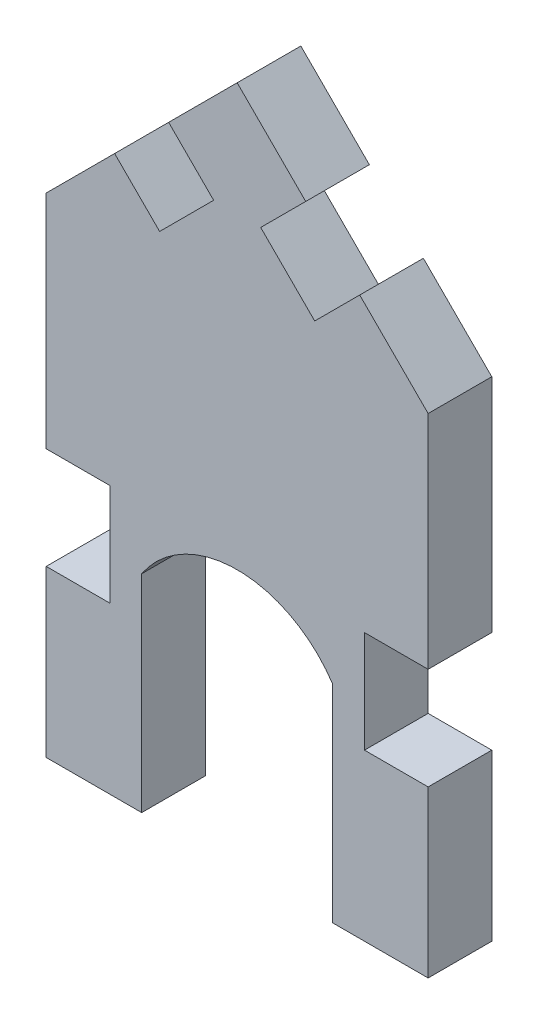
ISO-10303-21;
HEADER;
FILE_DESCRIPTION(('STEP AP214'),'2;1');
FILE_NAME('part.step','',(''),(''),'','','');
FILE_SCHEMA(('AUTOMOTIVE_DESIGN { 1 0 10303 214 1 1 1 1 }'));
ENDSEC;
DATA;
#1=APPLICATION_CONTEXT('core data for automotive mechanical design processes');
#2=APPLICATION_PROTOCOL_DEFINITION('international standard','automotive_design',2000,#1);
#3=PRODUCT_CONTEXT('',#1,'mechanical');
#4=PRODUCT('Part','Part','',(#3));
#5=PRODUCT_RELATED_PRODUCT_CATEGORY('part','',(#4));
#6=PRODUCT_DEFINITION_FORMATION('','',#4);
#7=PRODUCT_DEFINITION_CONTEXT('part definition',#1,'design');
#8=PRODUCT_DEFINITION('design','',#6,#7);
#9=PRODUCT_DEFINITION_SHAPE('','',#8);
#10=(LENGTH_UNIT() NAMED_UNIT(*) SI_UNIT(.MILLI.,.METRE.));
#11=(NAMED_UNIT(*) PLANE_ANGLE_UNIT() SI_UNIT($,.RADIAN.));
#12=(NAMED_UNIT(*) SI_UNIT($,.STERADIAN.) SOLID_ANGLE_UNIT());
#13=UNCERTAINTY_MEASURE_WITH_UNIT(LENGTH_MEASURE(1.E-05),#10,'distance_accuracy_value','');
#14=(GEOMETRIC_REPRESENTATION_CONTEXT(3) GLOBAL_UNCERTAINTY_ASSIGNED_CONTEXT((#13)) GLOBAL_UNIT_ASSIGNED_CONTEXT((#10,
#11,#12)) REPRESENTATION_CONTEXT('',''));
#15=CARTESIAN_POINT('',(0.,0.,0.));
#16=DIRECTION('',(0.,0.,1.));
#17=DIRECTION('',(1.,0.,0.));
#18=AXIS2_PLACEMENT_3D('',#15,#16,#17);
#19=CARTESIAN_POINT('',(21.209,21.2090000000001,6.35));
#20=DIRECTION('',(0.707106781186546,0.707106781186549,0.));
#21=DIRECTION('',(-0.707106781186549,0.707106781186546,0.));
#22=AXIS2_PLACEMENT_3D('',#19,#20,#21);
#23=PLANE('',#22);
#24=DIRECTION('',(0.,0.,1.));
#25=VECTOR('',#24,1.);
#26=CARTESIAN_POINT('',(-6.8249946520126,49.2429946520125,0.));
#27=LINE('',#26,#25);
#28=CARTESIAN_POINT('',(-6.8249946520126,49.2429946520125,0.));
#29=VERTEX_POINT('',#28);
#30=CARTESIAN_POINT('',(-6.8249946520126,49.2429946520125,6.35));
#31=VERTEX_POINT('',#30);
#32=EDGE_CURVE('E210',#29,#31,#27,.T.);
#33=ORIENTED_EDGE('',*,*,#32,.T.);
#34=DIRECTION('',(0.707106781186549,-0.707106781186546,0.));
#35=VECTOR('',#34,1.);
#36=CARTESIAN_POINT('',(21.209,21.2090000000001,6.35));
#37=LINE('',#36,#35);
#38=CARTESIAN_POINT('',(0.,42.418,6.35));
#39=VERTEX_POINT('',#38);
#40=EDGE_CURVE('E268',#31,#39,#37,.T.);
#41=ORIENTED_EDGE('',*,*,#40,.T.);
#42=DIRECTION('',(0.,0.,-1.));
#43=VECTOR('',#42,1.);
#44=CARTESIAN_POINT('',(0.,42.418,6.35));
#45=LINE('',#44,#43);
#46=CARTESIAN_POINT('',(0.,42.418,0.));
#47=VERTEX_POINT('',#46);
#48=EDGE_CURVE('E232',#39,#47,#45,.T.);
#49=ORIENTED_EDGE('',*,*,#48,.T.);
#50=DIRECTION('',(0.707106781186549,-0.707106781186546,0.));
#51=VECTOR('',#50,1.);
#52=CARTESIAN_POINT('',(21.209,21.2090000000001,0.));
#53=LINE('',#52,#51);
#54=EDGE_CURVE('E224',#29,#47,#53,.T.);
#55=ORIENTED_EDGE('',*,*,#54,.F.);
#56=EDGE_LOOP('',(#33,#41,#49,#55));
#57=FACE_BOUND('',#56,.T.);
#58=ADVANCED_FACE('F43',(#57),#23,.T.);
#59=CARTESIAN_POINT('',(-40.2589999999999,40.2590000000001,6.35));
#60=DIRECTION('',(-0.707106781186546,0.707106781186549,0.));
#61=DIRECTION('',(-0.707106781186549,-0.707106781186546,0.));
#62=AXIS2_PLACEMENT_3D('',#59,#60,#61);
#63=PLANE('',#62);
#64=DIRECTION('',(0.,0.,1.));
#65=VECTOR('',#64,1.);
#66=CARTESIAN_POINT('',(-31.2750053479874,49.2429946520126,0.));
#67=LINE('',#66,#65);
#68=CARTESIAN_POINT('',(-31.2750053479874,49.2429946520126,0.));
#69=VERTEX_POINT('',#68);
#70=CARTESIAN_POINT('',(-31.2750053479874,49.2429946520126,6.35));
#71=VERTEX_POINT('',#70);
#72=EDGE_CURVE('E297',#69,#71,#67,.T.);
#73=ORIENTED_EDGE('',*,*,#72,.F.);
#74=DIRECTION('',(0.707106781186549,0.707106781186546,0.));
#75=VECTOR('',#74,1.);
#76=CARTESIAN_POINT('',(-40.2589999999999,40.2590000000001,0.));
#77=LINE('',#76,#75);
#78=CARTESIAN_POINT('',(-38.1,42.418,0.));
#79=VERTEX_POINT('',#78);
#80=EDGE_CURVE('E245',#79,#69,#77,.T.);
#81=ORIENTED_EDGE('',*,*,#80,.F.);
#82=DIRECTION('',(0.,0.,-1.));
#83=VECTOR('',#82,1.);
#84=CARTESIAN_POINT('',(-38.1,42.418,6.35));
#85=LINE('',#84,#83);
#86=CARTESIAN_POINT('',(-38.1,42.418,6.35));
#87=VERTEX_POINT('',#86);
#88=EDGE_CURVE('E51',#87,#79,#85,.T.);
#89=ORIENTED_EDGE('',*,*,#88,.F.);
#90=DIRECTION('',(0.707106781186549,0.707106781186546,0.));
#91=VECTOR('',#90,1.);
#92=CARTESIAN_POINT('',(-40.2589999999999,40.2590000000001,6.35));
#93=LINE('',#92,#91);
#94=EDGE_CURVE('E357',#87,#71,#93,.T.);
#95=ORIENTED_EDGE('',*,*,#94,.T.);
#96=EDGE_LOOP('',(#73,#81,#89,#95));
#97=FACE_BOUND('',#96,.T.);
#98=ADVANCED_FACE('F296',(#97),#63,.T.);
#99=CARTESIAN_POINT('',(-38.1,0.,6.35));
#100=DIRECTION('',(-1.,0.,0.));
#101=DIRECTION('',(0.,-1.,0.));
#102=AXIS2_PLACEMENT_3D('',#99,#100,#101);
#103=PLANE('',#102);
#104=DIRECTION('',(0.,0.,1.));
#105=VECTOR('',#104,1.);
#106=CARTESIAN_POINT('',(-38.1,20.32,0.));
#107=LINE('',#106,#105);
#108=CARTESIAN_POINT('',(-38.1,20.32,0.));
#109=VERTEX_POINT('',#108);
#110=CARTESIAN_POINT('',(-38.1,20.32,6.35));
#111=VERTEX_POINT('',#110);
#112=EDGE_CURVE('E234',#109,#111,#107,.T.);
#113=ORIENTED_EDGE('',*,*,#112,.T.);
#114=DIRECTION('',(0.,1.,0.));
#115=VECTOR('',#114,1.);
#116=CARTESIAN_POINT('',(-38.1,0.,6.35));
#117=LINE('',#116,#115);
#118=EDGE_CURVE('E291',#111,#87,#117,.T.);
#119=ORIENTED_EDGE('',*,*,#118,.T.);
#120=ORIENTED_EDGE('',*,*,#88,.T.);
#121=DIRECTION('',(0.,1.,0.));
#122=VECTOR('',#121,1.);
#123=CARTESIAN_POINT('',(-38.1,0.,0.));
#124=LINE('',#123,#122);
#125=EDGE_CURVE('E248',#109,#79,#124,.T.);
#126=ORIENTED_EDGE('',*,*,#125,.F.);
#127=EDGE_LOOP('',(#113,#119,#120,#126));
#128=FACE_BOUND('',#127,.T.);
#129=ADVANCED_FACE('F289',(#128),#103,.T.);
#130=CARTESIAN_POINT('',(0.,0.,6.35));
#131=DIRECTION('',(-1.,0.,0.));
#132=DIRECTION('',(0.,0.,1.));
#133=AXIS2_PLACEMENT_3D('',#130,#131,#132);
#134=PLANE('',#133);
#135=DIRECTION('',(0.,1.,0.));
#136=VECTOR('',#135,1.);
#137=CARTESIAN_POINT('',(0.,0.,0.));
#138=LINE('',#137,#136);
#139=CARTESIAN_POINT('',(0.,-6.35,0.));
#140=VERTEX_POINT('',#139);
#141=CARTESIAN_POINT('',(0.,10.16,0.));
#142=VERTEX_POINT('',#141);
#143=EDGE_CURVE('E265',#140,#142,#138,.T.);
#144=ORIENTED_EDGE('',*,*,#143,.T.);
#145=DIRECTION('',(0.,0.,1.));
#146=VECTOR('',#145,1.);
#147=CARTESIAN_POINT('',(0.,10.16,0.));
#148=LINE('',#147,#146);
#149=CARTESIAN_POINT('',(0.,10.16,6.35));
#150=VERTEX_POINT('',#149);
#151=EDGE_CURVE('E334',#142,#150,#148,.T.);
#152=ORIENTED_EDGE('',*,*,#151,.T.);
#153=DIRECTION('',(0.,1.,0.));
#154=VECTOR('',#153,1.);
#155=CARTESIAN_POINT('',(0.,0.,6.35));
#156=LINE('',#155,#154);
#157=CARTESIAN_POINT('',(0.,-6.35,6.35));
#158=VERTEX_POINT('',#157);
#159=EDGE_CURVE('E243',#158,#150,#156,.T.);
#160=ORIENTED_EDGE('',*,*,#159,.F.);
#161=DIRECTION('',(0.,0.,-1.));
#162=VECTOR('',#161,1.);
#163=CARTESIAN_POINT('',(0.,-6.35,6.35));
#164=LINE('',#163,#162);
#165=EDGE_CURVE('E270',#158,#140,#164,.T.);
#166=ORIENTED_EDGE('',*,*,#165,.T.);
#167=EDGE_LOOP('',(#144,#152,#160,#166));
#168=FACE_BOUND('',#167,.T.);
#169=ADVANCED_FACE('F385',(#168),#134,.F.);
#170=DIRECTION('',(0.,0.,1.));
#171=VECTOR('',#170,1.);
#172=CARTESIAN_POINT('',(-12.2131483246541,54.631148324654,0.));
#173=LINE('',#172,#171);
#174=CARTESIAN_POINT('',(-12.2131483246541,54.631148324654,0.));
#175=VERTEX_POINT('',#174);
#176=CARTESIAN_POINT('',(-12.2131483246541,54.631148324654,6.35));
#177=VERTEX_POINT('',#176);
#178=EDGE_CURVE('E219',#175,#177,#173,.T.);
#179=ORIENTED_EDGE('',*,*,#178,.F.);
#180=CARTESIAN_POINT('',(-19.05,61.4679999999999,0.));
#181=VERTEX_POINT('',#180);
#182=EDGE_CURVE('E233',#181,#175,#53,.T.);
#183=ORIENTED_EDGE('',*,*,#182,.F.);
#184=DIRECTION('',(0.,0.,-1.));
#185=VECTOR('',#184,1.);
#186=CARTESIAN_POINT('',(-19.05,61.4679999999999,6.35));
#187=LINE('',#186,#185);
#188=CARTESIAN_POINT('',(-19.05,61.4679999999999,6.35));
#189=VERTEX_POINT('',#188);
#190=EDGE_CURVE('E11',#189,#181,#187,.T.);
#191=ORIENTED_EDGE('',*,*,#190,.F.);
#192=EDGE_CURVE('E353',#189,#177,#37,.T.);
#193=ORIENTED_EDGE('',*,*,#192,.T.);
#194=EDGE_LOOP('',(#179,#183,#191,#193));
#195=FACE_BOUND('',#194,.T.);
#196=ADVANCED_FACE('F45',(#195),#23,.T.);
#197=DIRECTION('',(0.,0.,1.));
#198=VECTOR('',#197,1.);
#199=CARTESIAN_POINT('',(-25.886851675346,54.631148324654,0.));
#200=LINE('',#199,#198);
#201=CARTESIAN_POINT('',(-25.886851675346,54.631148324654,0.));
#202=VERTEX_POINT('',#201);
#203=CARTESIAN_POINT('',(-25.886851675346,54.631148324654,6.35));
#204=VERTEX_POINT('',#203);
#205=EDGE_CURVE('E455',#202,#204,#200,.T.);
#206=ORIENTED_EDGE('',*,*,#205,.T.);
#207=EDGE_CURVE('E356',#204,#189,#93,.T.);
#208=ORIENTED_EDGE('',*,*,#207,.T.);
#209=ORIENTED_EDGE('',*,*,#190,.T.);
#210=EDGE_CURVE('E237',#202,#181,#77,.T.);
#211=ORIENTED_EDGE('',*,*,#210,.F.);
#212=EDGE_LOOP('',(#206,#208,#209,#211));
#213=FACE_BOUND('',#212,.T.);
#214=ADVANCED_FACE('F419',(#213),#63,.T.);
#215=DIRECTION('',(0.,0.,1.));
#216=VECTOR('',#215,1.);
#217=CARTESIAN_POINT('',(-38.1,10.16,0.));
#218=LINE('',#217,#216);
#219=CARTESIAN_POINT('',(-38.1,10.16,0.));
#220=VERTEX_POINT('',#219);
#221=CARTESIAN_POINT('',(-38.1,10.16,6.35));
#222=VERTEX_POINT('',#221);
#223=EDGE_CURVE('E308',#220,#222,#218,.T.);
#224=ORIENTED_EDGE('',*,*,#223,.F.);
#225=CARTESIAN_POINT('',(-38.1,-6.35,0.));
#226=VERTEX_POINT('',#225);
#227=EDGE_CURVE('E249',#226,#220,#124,.T.);
#228=ORIENTED_EDGE('',*,*,#227,.F.);
#229=DIRECTION('',(0.,0.,-1.));
#230=VECTOR('',#229,1.);
#231=CARTESIAN_POINT('',(-38.1,-6.35,6.35));
#232=LINE('',#231,#230);
#233=CARTESIAN_POINT('',(-38.1,-6.35,6.35));
#234=VERTEX_POINT('',#233);
#235=EDGE_CURVE('E283',#234,#226,#232,.T.);
#236=ORIENTED_EDGE('',*,*,#235,.F.);
#237=EDGE_CURVE('E359',#234,#222,#117,.T.);
#238=ORIENTED_EDGE('',*,*,#237,.T.);
#239=EDGE_LOOP('',(#224,#228,#236,#238));
#240=FACE_BOUND('',#239,.T.);
#241=ADVANCED_FACE('F425',(#240),#103,.T.);
#242=CARTESIAN_POINT('',(0.,-6.35,6.35));
#243=DIRECTION('',(0.,1.,0.));
#244=DIRECTION('',(0.,0.,1.));
#245=AXIS2_PLACEMENT_3D('',#242,#243,#244);
#246=PLANE('',#245);
#247=DIRECTION('',(1.,0.,0.));
#248=VECTOR('',#247,1.);
#249=CARTESIAN_POINT('',(0.,-6.35,0.));
#250=LINE('',#249,#248);
#251=CARTESIAN_POINT('',(-28.575,-6.35,0.));
#252=VERTEX_POINT('',#251);
#253=EDGE_CURVE('E252',#226,#252,#250,.T.);
#254=ORIENTED_EDGE('',*,*,#253,.T.);
#255=DIRECTION('',(0.,0.,-1.));
#256=VECTOR('',#255,1.);
#257=CARTESIAN_POINT('',(-28.575,-6.35,6.35));
#258=LINE('',#257,#256);
#259=CARTESIAN_POINT('',(-28.575,-6.35,6.35));
#260=VERTEX_POINT('',#259);
#261=EDGE_CURVE('E280',#260,#252,#258,.T.);
#262=ORIENTED_EDGE('',*,*,#261,.F.);
#263=DIRECTION('',(1.,0.,0.));
#264=VECTOR('',#263,1.);
#265=CARTESIAN_POINT('',(0.,-6.35,6.35));
#266=LINE('',#265,#264);
#267=EDGE_CURVE('E362',#234,#260,#266,.T.);
#268=ORIENTED_EDGE('',*,*,#267,.F.);
#269=ORIENTED_EDGE('',*,*,#235,.T.);
#270=EDGE_LOOP('',(#254,#262,#268,#269));
#271=FACE_BOUND('',#270,.T.);
#272=ADVANCED_FACE('F671',(#271),#246,.F.);
#273=CARTESIAN_POINT('',(-28.575,0.,6.35));
#274=DIRECTION('',(-1.,0.,0.));
#275=DIRECTION('',(0.,0.,1.));
#276=AXIS2_PLACEMENT_3D('',#273,#274,#275);
#277=PLANE('',#276);
#278=DIRECTION('',(0.,1.,0.));
#279=VECTOR('',#278,1.);
#280=CARTESIAN_POINT('',(-28.575,0.,0.));
#281=LINE('',#280,#279);
#282=CARTESIAN_POINT('',(-28.575,14.2875,0.));
#283=VERTEX_POINT('',#282);
#284=EDGE_CURVE('E254',#252,#283,#281,.T.);
#285=ORIENTED_EDGE('',*,*,#284,.T.);
#286=DIRECTION('',(0.,0.,-1.));
#287=VECTOR('',#286,1.);
#288=CARTESIAN_POINT('',(-28.575,14.2875,6.35));
#289=LINE('',#288,#287);
#290=CARTESIAN_POINT('',(-28.575,14.2875,6.35));
#291=VERTEX_POINT('',#290);
#292=EDGE_CURVE('E277',#291,#283,#289,.T.);
#293=ORIENTED_EDGE('',*,*,#292,.F.);
#294=DIRECTION('',(0.,1.,0.));
#295=VECTOR('',#294,1.);
#296=CARTESIAN_POINT('',(-28.575,0.,6.35));
#297=LINE('',#296,#295);
#298=EDGE_CURVE('E364',#260,#291,#297,.T.);
#299=ORIENTED_EDGE('',*,*,#298,.F.);
#300=ORIENTED_EDGE('',*,*,#261,.T.);
#301=EDGE_LOOP('',(#285,#293,#299,#300));
#302=FACE_BOUND('',#301,.T.);
#303=ADVANCED_FACE('F661',(#302),#277,.F.);
#304=CARTESIAN_POINT('',(-19.05,7.96932977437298,6.35));
#305=DIRECTION('',(0.,0.,-1.));
#306=DIRECTION('',(-1.,0.,0.));
#307=AXIS2_PLACEMENT_3D('',#304,#305,#306);
#308=CYLINDRICAL_SURFACE('',#307,11.43);
#309=CARTESIAN_POINT('',(-19.05,7.96932977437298,0.));
#310=DIRECTION('',(0.,0.,1.));
#311=DIRECTION('',(1.,0.,0.));
#312=AXIS2_PLACEMENT_3D('',#309,#310,#311);
#313=CIRCLE('',#312,11.43);
#314=CARTESIAN_POINT('',(-9.52500000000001,14.2875,0.));
#315=VERTEX_POINT('',#314);
#316=EDGE_CURVE('E256',#283,#315,#313,.F.);
#317=ORIENTED_EDGE('',*,*,#316,.T.);
#318=DIRECTION('',(0.,0.,-1.));
#319=VECTOR('',#318,1.);
#320=CARTESIAN_POINT('',(-9.52500000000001,14.2875,6.35));
#321=LINE('',#320,#319);
#322=CARTESIAN_POINT('',(-9.52500000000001,14.2875,6.35));
#323=VERTEX_POINT('',#322);
#324=EDGE_CURVE('E275',#323,#315,#321,.T.);
#325=ORIENTED_EDGE('',*,*,#324,.F.);
#326=CARTESIAN_POINT('',(-19.05,7.96932977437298,6.35));
#327=DIRECTION('',(0.,0.,1.));
#328=DIRECTION('',(1.,0.,0.));
#329=AXIS2_PLACEMENT_3D('',#326,#327,#328);
#330=CIRCLE('',#329,11.43);
#331=EDGE_CURVE('E366',#291,#323,#330,.F.);
#332=ORIENTED_EDGE('',*,*,#331,.F.);
#333=ORIENTED_EDGE('',*,*,#292,.T.);
#334=EDGE_LOOP('',(#317,#325,#332,#333));
#335=FACE_BOUND('',#334,.T.);
#336=ADVANCED_FACE('F652',(#335),#308,.F.);
#337=CARTESIAN_POINT('',(-9.52500000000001,0.,6.35));
#338=DIRECTION('',(-1.,0.,0.));
#339=DIRECTION('',(0.,0.,1.));
#340=AXIS2_PLACEMENT_3D('',#337,#338,#339);
#341=PLANE('',#340);
#342=DIRECTION('',(0.,1.,0.));
#343=VECTOR('',#342,1.);
#344=CARTESIAN_POINT('',(-9.52500000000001,0.,0.));
#345=LINE('',#344,#343);
#346=CARTESIAN_POINT('',(-9.525,-6.35,0.));
#347=VERTEX_POINT('',#346);
#348=EDGE_CURVE('E259',#347,#315,#345,.T.);
#349=ORIENTED_EDGE('',*,*,#348,.F.);
#350=DIRECTION('',(0.,0.,-1.));
#351=VECTOR('',#350,1.);
#352=CARTESIAN_POINT('',(-9.525,-6.35,6.35));
#353=LINE('',#352,#351);
#354=CARTESIAN_POINT('',(-9.525,-6.35,6.35));
#355=VERTEX_POINT('',#354);
#356=EDGE_CURVE('E273',#355,#347,#353,.T.);
#357=ORIENTED_EDGE('',*,*,#356,.F.);
#358=DIRECTION('',(0.,1.,0.));
#359=VECTOR('',#358,1.);
#360=CARTESIAN_POINT('',(-9.52500000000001,0.,6.35));
#361=LINE('',#360,#359);
#362=EDGE_CURVE('E368',#355,#323,#361,.T.);
#363=ORIENTED_EDGE('',*,*,#362,.T.);
#364=ORIENTED_EDGE('',*,*,#324,.T.);
#365=EDGE_LOOP('',(#349,#357,#363,#364));
#366=FACE_BOUND('',#365,.T.);
#367=ADVANCED_FACE('F409',(#366),#341,.T.);
#368=CARTESIAN_POINT('',(0.,-6.35,6.35));
#369=DIRECTION('',(0.,1.,0.));
#370=DIRECTION('',(0.,0.,1.));
#371=AXIS2_PLACEMENT_3D('',#368,#369,#370);
#372=PLANE('',#371);
#373=DIRECTION('',(1.,0.,0.));
#374=VECTOR('',#373,1.);
#375=CARTESIAN_POINT('',(0.,-6.35,0.));
#376=LINE('',#375,#374);
#377=EDGE_CURVE('E262',#347,#140,#376,.T.);
#378=ORIENTED_EDGE('',*,*,#377,.T.);
#379=ORIENTED_EDGE('',*,*,#165,.F.);
#380=DIRECTION('',(1.,0.,0.));
#381=VECTOR('',#380,1.);
#382=CARTESIAN_POINT('',(0.,-6.35,6.35));
#383=LINE('',#382,#381);
#384=EDGE_CURVE('E370',#355,#158,#383,.T.);
#385=ORIENTED_EDGE('',*,*,#384,.F.);
#386=ORIENTED_EDGE('',*,*,#356,.T.);
#387=EDGE_LOOP('',(#378,#379,#385,#386));
#388=FACE_BOUND('',#387,.T.);
#389=ADVANCED_FACE('F400',(#388),#372,.F.);
#390=CARTESIAN_POINT('',(0.,20.32,6.35));
#391=VERTEX_POINT('',#390);
#392=EDGE_CURVE('E371',#391,#39,#156,.T.);
#393=ORIENTED_EDGE('',*,*,#392,.F.);
#394=DIRECTION('',(0.,0.,1.));
#395=VECTOR('',#394,1.);
#396=CARTESIAN_POINT('',(0.,20.32,0.));
#397=LINE('',#396,#395);
#398=CARTESIAN_POINT('',(0.,20.32,0.));
#399=VERTEX_POINT('',#398);
#400=EDGE_CURVE('E327',#399,#391,#397,.T.);
#401=ORIENTED_EDGE('',*,*,#400,.F.);
#402=EDGE_CURVE('E264',#399,#47,#138,.T.);
#403=ORIENTED_EDGE('',*,*,#402,.T.);
#404=ORIENTED_EDGE('',*,*,#48,.F.);
#405=EDGE_LOOP('',(#393,#401,#403,#404));
#406=FACE_BOUND('',#405,.T.);
#407=ADVANCED_FACE('F398',(#406),#134,.F.);
#408=CARTESIAN_POINT('',(0.,0.,6.35));
#409=DIRECTION('',(0.,0.,1.));
#410=DIRECTION('',(1.,0.,0.));
#411=AXIS2_PLACEMENT_3D('',#408,#409,#410);
#412=PLANE('',#411);
#413=DIRECTION('',(0.707106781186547,0.707106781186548,0.));
#414=VECTOR('',#413,1.);
#415=CARTESIAN_POINT('',(-6.8249946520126,49.2429946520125,6.35));
#416=LINE('',#415,#414);
#417=CARTESIAN_POINT('',(-11.3151227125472,44.7528665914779,6.35));
#418=VERTEX_POINT('',#417);
#419=EDGE_CURVE('E215',#418,#31,#416,.T.);
#420=ORIENTED_EDGE('',*,*,#419,.F.);
#421=DIRECTION('',(0.707106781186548,-0.707106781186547,0.));
#422=VECTOR('',#421,1.);
#423=CARTESIAN_POINT('',(-11.3151227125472,44.7528665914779,6.35));
#424=LINE('',#423,#422);
#425=CARTESIAN_POINT('',(-16.7032763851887,50.1410202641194,6.35));
#426=VERTEX_POINT('',#425);
#427=EDGE_CURVE('E228',#426,#418,#424,.T.);
#428=ORIENTED_EDGE('',*,*,#427,.F.);
#429=DIRECTION('',(-0.707106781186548,-0.707106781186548,0.));
#430=VECTOR('',#429,1.);
#431=CARTESIAN_POINT('',(-12.2131483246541,54.631148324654,6.35));
#432=LINE('',#431,#430);
#433=EDGE_CURVE('E441',#177,#426,#432,.T.);
#434=ORIENTED_EDGE('',*,*,#433,.F.);
#435=ORIENTED_EDGE('',*,*,#192,.F.);
#436=ORIENTED_EDGE('',*,*,#207,.F.);
#437=DIRECTION('',(-0.707106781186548,0.707106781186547,0.));
#438=VECTOR('',#437,1.);
#439=CARTESIAN_POINT('',(-25.886851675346,54.631148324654,6.35));
#440=LINE('',#439,#438);
#441=CARTESIAN_POINT('',(-21.3967236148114,50.1410202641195,6.35));
#442=VERTEX_POINT('',#441);
#443=EDGE_CURVE('E458',#442,#204,#440,.T.);
#444=ORIENTED_EDGE('',*,*,#443,.F.);
#445=DIRECTION('',(0.707106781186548,0.707106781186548,0.));
#446=VECTOR('',#445,1.);
#447=CARTESIAN_POINT('',(-26.7848772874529,44.752866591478,6.35));
#448=LINE('',#447,#446);
#449=CARTESIAN_POINT('',(-26.7848772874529,44.752866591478,6.35));
#450=VERTEX_POINT('',#449);
#451=EDGE_CURVE('E460',#450,#442,#448,.T.);
#452=ORIENTED_EDGE('',*,*,#451,.F.);
#453=DIRECTION('',(0.707106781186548,-0.707106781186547,0.));
#454=VECTOR('',#453,1.);
#455=CARTESIAN_POINT('',(-31.2750053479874,49.2429946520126,6.35));
#456=LINE('',#455,#454);
#457=EDGE_CURVE('E445',#71,#450,#456,.T.);
#458=ORIENTED_EDGE('',*,*,#457,.F.);
#459=ORIENTED_EDGE('',*,*,#94,.F.);
#460=ORIENTED_EDGE('',*,*,#118,.F.);
#461=DIRECTION('',(-1.,0.,0.));
#462=VECTOR('',#461,1.);
#463=CARTESIAN_POINT('',(-38.1,20.32,6.35));
#464=LINE('',#463,#462);
#465=CARTESIAN_POINT('',(-31.75,20.32,6.35));
#466=VERTEX_POINT('',#465);
#467=EDGE_CURVE('E323',#466,#111,#464,.T.);
#468=ORIENTED_EDGE('',*,*,#467,.F.);
#469=DIRECTION('',(0.,1.,0.));
#470=VECTOR('',#469,1.);
#471=CARTESIAN_POINT('',(-31.75,20.32,6.35));
#472=LINE('',#471,#470);
#473=CARTESIAN_POINT('',(-31.75,10.16,6.35));
#474=VERTEX_POINT('',#473);
#475=EDGE_CURVE('E319',#474,#466,#472,.T.);
#476=ORIENTED_EDGE('',*,*,#475,.F.);
#477=DIRECTION('',(1.,0.,0.));
#478=VECTOR('',#477,1.);
#479=CARTESIAN_POINT('',(-38.1,10.16,6.35));
#480=LINE('',#479,#478);
#481=EDGE_CURVE('E316',#222,#474,#480,.T.);
#482=ORIENTED_EDGE('',*,*,#481,.F.);
#483=ORIENTED_EDGE('',*,*,#237,.F.);
#484=ORIENTED_EDGE('',*,*,#267,.T.);
#485=ORIENTED_EDGE('',*,*,#298,.T.);
#486=ORIENTED_EDGE('',*,*,#331,.T.);
#487=ORIENTED_EDGE('',*,*,#362,.F.);
#488=ORIENTED_EDGE('',*,*,#384,.T.);
#489=ORIENTED_EDGE('',*,*,#159,.T.);
#490=DIRECTION('',(1.,0.,0.));
#491=VECTOR('',#490,1.);
#492=CARTESIAN_POINT('',(0.,10.16,6.35));
#493=LINE('',#492,#491);
#494=CARTESIAN_POINT('',(-6.35,10.16,6.35));
#495=VERTEX_POINT('',#494);
#496=EDGE_CURVE('E338',#495,#150,#493,.T.);
#497=ORIENTED_EDGE('',*,*,#496,.F.);
#498=DIRECTION('',(0.,-1.,0.));
#499=VECTOR('',#498,1.);
#500=CARTESIAN_POINT('',(-6.35,20.32,6.35));
#501=LINE('',#500,#499);
#502=CARTESIAN_POINT('',(-6.35,20.32,6.35));
#503=VERTEX_POINT('',#502);
#504=EDGE_CURVE('E340',#503,#495,#501,.T.);
#505=ORIENTED_EDGE('',*,*,#504,.F.);
#506=DIRECTION('',(-1.,0.,0.));
#507=VECTOR('',#506,1.);
#508=CARTESIAN_POINT('',(0.,20.32,6.35));
#509=LINE('',#508,#507);
#510=EDGE_CURVE('E320',#391,#503,#509,.T.);
#511=ORIENTED_EDGE('',*,*,#510,.F.);
#512=ORIENTED_EDGE('',*,*,#392,.T.);
#513=ORIENTED_EDGE('',*,*,#40,.F.);
#514=EDGE_LOOP('',(#420,#428,#434,#435,#436,#444,#452,#458,#459,#460,#468,#476,#482,#483,#484,
#485,#486,#487,#488,#489,#497,#505,#511,#512,#513));
#515=FACE_BOUND('',#514,.T.);
#516=ADVANCED_FACE('F382',(#515),#412,.T.);
#517=CARTESIAN_POINT('',(0.,0.,0.));
#518=DIRECTION('',(0.,0.,1.));
#519=DIRECTION('',(1.,0.,0.));
#520=AXIS2_PLACEMENT_3D('',#517,#518,#519);
#521=PLANE('',#520);
#522=DIRECTION('',(0.707106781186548,-0.707106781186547,0.));
#523=VECTOR('',#522,1.);
#524=CARTESIAN_POINT('',(-11.3151227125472,44.7528665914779,0.));
#525=LINE('',#524,#523);
#526=CARTESIAN_POINT('',(-16.7032763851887,50.1410202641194,0.));
#527=VERTEX_POINT('',#526);
#528=CARTESIAN_POINT('',(-11.3151227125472,44.7528665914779,0.));
#529=VERTEX_POINT('',#528);
#530=EDGE_CURVE('E58',#527,#529,#525,.T.);
#531=ORIENTED_EDGE('',*,*,#530,.T.);
#532=DIRECTION('',(0.707106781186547,0.707106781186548,0.));
#533=VECTOR('',#532,1.);
#534=CARTESIAN_POINT('',(-6.8249946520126,49.2429946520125,0.));
#535=LINE('',#534,#533);
#536=EDGE_CURVE('E213',#529,#29,#535,.T.);
#537=ORIENTED_EDGE('',*,*,#536,.T.);
#538=ORIENTED_EDGE('',*,*,#54,.T.);
#539=ORIENTED_EDGE('',*,*,#402,.F.);
#540=DIRECTION('',(-1.,0.,0.));
#541=VECTOR('',#540,1.);
#542=CARTESIAN_POINT('',(0.,20.32,0.));
#543=LINE('',#542,#541);
#544=CARTESIAN_POINT('',(-6.35,20.32,0.));
#545=VERTEX_POINT('',#544);
#546=EDGE_CURVE('E341',#399,#545,#543,.T.);
#547=ORIENTED_EDGE('',*,*,#546,.T.);
#548=DIRECTION('',(0.,-1.,0.));
#549=VECTOR('',#548,1.);
#550=CARTESIAN_POINT('',(-6.35,20.32,0.));
#551=LINE('',#550,#549);
#552=CARTESIAN_POINT('',(-6.35,10.16,0.));
#553=VERTEX_POINT('',#552);
#554=EDGE_CURVE('E348',#545,#553,#551,.T.);
#555=ORIENTED_EDGE('',*,*,#554,.T.);
#556=DIRECTION('',(1.,0.,0.));
#557=VECTOR('',#556,1.);
#558=CARTESIAN_POINT('',(0.,10.16,0.));
#559=LINE('',#558,#557);
#560=EDGE_CURVE('E329',#553,#142,#559,.T.);
#561=ORIENTED_EDGE('',*,*,#560,.T.);
#562=ORIENTED_EDGE('',*,*,#143,.F.);
#563=ORIENTED_EDGE('',*,*,#377,.F.);
#564=ORIENTED_EDGE('',*,*,#348,.T.);
#565=ORIENTED_EDGE('',*,*,#316,.F.);
#566=ORIENTED_EDGE('',*,*,#284,.F.);
#567=ORIENTED_EDGE('',*,*,#253,.F.);
#568=ORIENTED_EDGE('',*,*,#227,.T.);
#569=DIRECTION('',(1.,0.,0.));
#570=VECTOR('',#569,1.);
#571=CARTESIAN_POINT('',(-38.1,10.16,0.));
#572=LINE('',#571,#570);
#573=CARTESIAN_POINT('',(-31.75,10.16,0.));
#574=VERTEX_POINT('',#573);
#575=EDGE_CURVE('E312',#220,#574,#572,.T.);
#576=ORIENTED_EDGE('',*,*,#575,.T.);
#577=DIRECTION('',(0.,1.,0.));
#578=VECTOR('',#577,1.);
#579=CARTESIAN_POINT('',(-31.75,20.32,0.));
#580=LINE('',#579,#578);
#581=CARTESIAN_POINT('',(-31.75,20.32,0.));
#582=VERTEX_POINT('',#581);
#583=EDGE_CURVE('E306',#574,#582,#580,.T.);
#584=ORIENTED_EDGE('',*,*,#583,.T.);
#585=DIRECTION('',(-1.,0.,0.));
#586=VECTOR('',#585,1.);
#587=CARTESIAN_POINT('',(-38.1,20.32,0.));
#588=LINE('',#587,#586);
#589=EDGE_CURVE('E304',#582,#109,#588,.T.);
#590=ORIENTED_EDGE('',*,*,#589,.T.);
#591=ORIENTED_EDGE('',*,*,#125,.T.);
#592=ORIENTED_EDGE('',*,*,#80,.T.);
#593=DIRECTION('',(0.707106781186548,-0.707106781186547,0.));
#594=VECTOR('',#593,1.);
#595=CARTESIAN_POINT('',(-31.2750053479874,49.2429946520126,0.));
#596=LINE('',#595,#594);
#597=CARTESIAN_POINT('',(-26.7848772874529,44.752866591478,0.));
#598=VERTEX_POINT('',#597);
#599=EDGE_CURVE('E300',#69,#598,#596,.T.);
#600=ORIENTED_EDGE('',*,*,#599,.T.);
#601=DIRECTION('',(0.707106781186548,0.707106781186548,0.));
#602=VECTOR('',#601,1.);
#603=CARTESIAN_POINT('',(-26.7848772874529,44.752866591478,0.));
#604=LINE('',#603,#602);
#605=CARTESIAN_POINT('',(-21.3967236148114,50.1410202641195,0.));
#606=VERTEX_POINT('',#605);
#607=EDGE_CURVE('E466',#598,#606,#604,.T.);
#608=ORIENTED_EDGE('',*,*,#607,.T.);
#609=DIRECTION('',(-0.707106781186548,0.707106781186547,0.));
#610=VECTOR('',#609,1.);
#611=CARTESIAN_POINT('',(-25.886851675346,54.631148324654,0.));
#612=LINE('',#611,#610);
#613=EDGE_CURVE('E66',#606,#202,#612,.T.);
#614=ORIENTED_EDGE('',*,*,#613,.T.);
#615=ORIENTED_EDGE('',*,*,#210,.T.);
#616=ORIENTED_EDGE('',*,*,#182,.T.);
#617=DIRECTION('',(-0.707106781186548,-0.707106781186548,0.));
#618=VECTOR('',#617,1.);
#619=CARTESIAN_POINT('',(-12.2131483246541,54.631148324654,0.));
#620=LINE('',#619,#618);
#621=EDGE_CURVE('E227',#175,#527,#620,.T.);
#622=ORIENTED_EDGE('',*,*,#621,.T.);
#623=EDGE_LOOP('',(#531,#537,#538,#539,#547,#555,#561,#562,#563,#564,#565,#566,#567,#568,#576,
#584,#590,#591,#592,#600,#608,#614,#615,#616,#622));
#624=FACE_BOUND('',#623,.T.);
#625=ADVANCED_FACE('F222',(#624),#521,.F.);
#626=CARTESIAN_POINT('',(0.,10.16,0.));
#627=DIRECTION('',(0.,-1.,0.));
#628=DIRECTION('',(0.,0.,-1.));
#629=AXIS2_PLACEMENT_3D('',#626,#627,#628);
#630=PLANE('',#629);
#631=ORIENTED_EDGE('',*,*,#496,.T.);
#632=ORIENTED_EDGE('',*,*,#151,.F.);
#633=ORIENTED_EDGE('',*,*,#560,.F.);
#634=DIRECTION('',(0.,0.,1.));
#635=VECTOR('',#634,1.);
#636=CARTESIAN_POINT('',(-6.35,10.16,0.));
#637=LINE('',#636,#635);
#638=EDGE_CURVE('E332',#553,#495,#637,.T.);
#639=ORIENTED_EDGE('',*,*,#638,.T.);
#640=EDGE_LOOP('',(#631,#632,#633,#639));
#641=FACE_BOUND('',#640,.T.);
#642=ADVANCED_FACE('F389',(#641),#630,.F.);
#643=CARTESIAN_POINT('',(-6.35,20.32,0.));
#644=DIRECTION('',(-1.,0.,0.));
#645=DIRECTION('',(0.,-1.,0.));
#646=AXIS2_PLACEMENT_3D('',#643,#644,#645);
#647=PLANE('',#646);
#648=ORIENTED_EDGE('',*,*,#504,.T.);
#649=ORIENTED_EDGE('',*,*,#638,.F.);
#650=ORIENTED_EDGE('',*,*,#554,.F.);
#651=DIRECTION('',(0.,0.,1.));
#652=VECTOR('',#651,1.);
#653=CARTESIAN_POINT('',(-6.35,20.32,0.));
#654=LINE('',#653,#652);
#655=EDGE_CURVE('E330',#545,#503,#654,.T.);
#656=ORIENTED_EDGE('',*,*,#655,.T.);
#657=EDGE_LOOP('',(#648,#649,#650,#656));
#658=FACE_BOUND('',#657,.T.);
#659=ADVANCED_FACE('F393',(#658),#647,.F.);
#660=CARTESIAN_POINT('',(0.,20.32,0.));
#661=DIRECTION('',(0.,1.,0.));
#662=DIRECTION('',(0.,0.,1.));
#663=AXIS2_PLACEMENT_3D('',#660,#661,#662);
#664=PLANE('',#663);
#665=ORIENTED_EDGE('',*,*,#510,.T.);
#666=ORIENTED_EDGE('',*,*,#655,.F.);
#667=ORIENTED_EDGE('',*,*,#546,.F.);
#668=ORIENTED_EDGE('',*,*,#400,.T.);
#669=EDGE_LOOP('',(#665,#666,#667,#668));
#670=FACE_BOUND('',#669,.T.);
#671=ADVANCED_FACE('F395',(#670),#664,.F.);
#672=CARTESIAN_POINT('',(-38.1,20.32,0.));
#673=DIRECTION('',(0.,1.,0.));
#674=DIRECTION('',(0.,0.,1.));
#675=AXIS2_PLACEMENT_3D('',#672,#673,#674);
#676=PLANE('',#675);
#677=ORIENTED_EDGE('',*,*,#467,.T.);
#678=ORIENTED_EDGE('',*,*,#112,.F.);
#679=ORIENTED_EDGE('',*,*,#589,.F.);
#680=DIRECTION('',(0.,0.,1.));
#681=VECTOR('',#680,1.);
#682=CARTESIAN_POINT('',(-31.75,20.32,0.));
#683=LINE('',#682,#681);
#684=EDGE_CURVE('E239',#582,#466,#683,.T.);
#685=ORIENTED_EDGE('',*,*,#684,.T.);
#686=EDGE_LOOP('',(#677,#678,#679,#685));
#687=FACE_BOUND('',#686,.T.);
#688=ADVANCED_FACE('F483',(#687),#676,.F.);
#689=CARTESIAN_POINT('',(-31.75,20.32,0.));
#690=DIRECTION('',(1.,0.,0.));
#691=DIRECTION('',(0.,0.,-1.));
#692=AXIS2_PLACEMENT_3D('',#689,#690,#691);
#693=PLANE('',#692);
#694=ORIENTED_EDGE('',*,*,#475,.T.);
#695=ORIENTED_EDGE('',*,*,#684,.F.);
#696=ORIENTED_EDGE('',*,*,#583,.F.);
#697=DIRECTION('',(0.,0.,1.));
#698=VECTOR('',#697,1.);
#699=CARTESIAN_POINT('',(-31.75,10.16,0.));
#700=LINE('',#699,#698);
#701=EDGE_CURVE('E310',#574,#474,#700,.T.);
#702=ORIENTED_EDGE('',*,*,#701,.T.);
#703=EDGE_LOOP('',(#694,#695,#696,#702));
#704=FACE_BOUND('',#703,.T.);
#705=ADVANCED_FACE('F482',(#704),#693,.F.);
#706=CARTESIAN_POINT('',(-38.1,10.16,0.));
#707=DIRECTION('',(0.,-1.,0.));
#708=DIRECTION('',(0.,0.,-1.));
#709=AXIS2_PLACEMENT_3D('',#706,#707,#708);
#710=PLANE('',#709);
#711=ORIENTED_EDGE('',*,*,#481,.T.);
#712=ORIENTED_EDGE('',*,*,#701,.F.);
#713=ORIENTED_EDGE('',*,*,#575,.F.);
#714=ORIENTED_EDGE('',*,*,#223,.T.);
#715=EDGE_LOOP('',(#711,#712,#713,#714));
#716=FACE_BOUND('',#715,.T.);
#717=ADVANCED_FACE('F473',(#716),#710,.F.);
#718=CARTESIAN_POINT('',(-31.2750053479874,49.2429946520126,0.));
#719=DIRECTION('',(-0.707106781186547,-0.707106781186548,0.));
#720=DIRECTION('',(0.707106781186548,-0.707106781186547,0.));
#721=AXIS2_PLACEMENT_3D('',#718,#719,#720);
#722=PLANE('',#721);
#723=ORIENTED_EDGE('',*,*,#457,.T.);
#724=DIRECTION('',(0.,0.,1.));
#725=VECTOR('',#724,1.);
#726=CARTESIAN_POINT('',(-26.7848772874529,44.752866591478,0.));
#727=LINE('',#726,#725);
#728=EDGE_CURVE('E451',#598,#450,#727,.T.);
#729=ORIENTED_EDGE('',*,*,#728,.F.);
#730=ORIENTED_EDGE('',*,*,#599,.F.);
#731=ORIENTED_EDGE('',*,*,#72,.T.);
#732=EDGE_LOOP('',(#723,#729,#730,#731));
#733=FACE_BOUND('',#732,.T.);
#734=ADVANCED_FACE('F487',(#733),#722,.F.);
#735=CARTESIAN_POINT('',(-25.886851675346,54.631148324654,0.));
#736=DIRECTION('',(0.707106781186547,0.707106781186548,0.));
#737=DIRECTION('',(-0.707106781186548,0.707106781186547,0.));
#738=AXIS2_PLACEMENT_3D('',#735,#736,#737);
#739=PLANE('',#738);
#740=ORIENTED_EDGE('',*,*,#443,.T.);
#741=ORIENTED_EDGE('',*,*,#205,.F.);
#742=ORIENTED_EDGE('',*,*,#613,.F.);
#743=DIRECTION('',(0.,0.,1.));
#744=VECTOR('',#743,1.);
#745=CARTESIAN_POINT('',(-21.3967236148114,50.1410202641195,0.));
#746=LINE('',#745,#744);
#747=EDGE_CURVE('E453',#606,#442,#746,.T.);
#748=ORIENTED_EDGE('',*,*,#747,.T.);
#749=EDGE_LOOP('',(#740,#741,#742,#748));
#750=FACE_BOUND('',#749,.T.);
#751=ADVANCED_FACE('F491',(#750),#739,.F.);
#752=CARTESIAN_POINT('',(-26.7848772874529,44.752866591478,0.));
#753=DIRECTION('',(0.707106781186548,-0.707106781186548,0.));
#754=DIRECTION('',(0.707106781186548,0.707106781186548,0.));
#755=AXIS2_PLACEMENT_3D('',#752,#753,#754);
#756=PLANE('',#755);
#757=ORIENTED_EDGE('',*,*,#451,.T.);
#758=ORIENTED_EDGE('',*,*,#747,.F.);
#759=ORIENTED_EDGE('',*,*,#607,.F.);
#760=ORIENTED_EDGE('',*,*,#728,.T.);
#761=EDGE_LOOP('',(#757,#758,#759,#760));
#762=FACE_BOUND('',#761,.T.);
#763=ADVANCED_FACE('F490',(#762),#756,.F.);
#764=CARTESIAN_POINT('',(-6.8249946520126,49.2429946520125,0.));
#765=DIRECTION('',(0.707106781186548,-0.707106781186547,0.));
#766=DIRECTION('',(0.707106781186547,0.707106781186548,0.));
#767=AXIS2_PLACEMENT_3D('',#764,#765,#766);
#768=PLANE('',#767);
#769=ORIENTED_EDGE('',*,*,#419,.T.);
#770=ORIENTED_EDGE('',*,*,#32,.F.);
#771=ORIENTED_EDGE('',*,*,#536,.F.);
#772=DIRECTION('',(0.,0.,1.));
#773=VECTOR('',#772,1.);
#774=CARTESIAN_POINT('',(-11.3151227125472,44.7528665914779,0.));
#775=LINE('',#774,#773);
#776=EDGE_CURVE('E337',#529,#418,#775,.T.);
#777=ORIENTED_EDGE('',*,*,#776,.T.);
#778=EDGE_LOOP('',(#769,#770,#771,#777));
#779=FACE_BOUND('',#778,.T.);
#780=ADVANCED_FACE('F212',(#779),#768,.F.);
#781=CARTESIAN_POINT('',(-11.3151227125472,44.7528665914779,0.));
#782=DIRECTION('',(-0.707106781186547,-0.707106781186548,0.));
#783=DIRECTION('',(0.707106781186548,-0.707106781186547,0.));
#784=AXIS2_PLACEMENT_3D('',#781,#782,#783);
#785=PLANE('',#784);
#786=ORIENTED_EDGE('',*,*,#427,.T.);
#787=ORIENTED_EDGE('',*,*,#776,.F.);
#788=ORIENTED_EDGE('',*,*,#530,.F.);
#789=DIRECTION('',(0.,0.,1.));
#790=VECTOR('',#789,1.);
#791=CARTESIAN_POINT('',(-16.7032763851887,50.1410202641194,0.));
#792=LINE('',#791,#790);
#793=EDGE_CURVE('E434',#527,#426,#792,.T.);
#794=ORIENTED_EDGE('',*,*,#793,.T.);
#795=EDGE_LOOP('',(#786,#787,#788,#794));
#796=FACE_BOUND('',#795,.T.);
#797=ADVANCED_FACE('F545',(#796),#785,.F.);
#798=CARTESIAN_POINT('',(-12.2131483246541,54.631148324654,0.));
#799=DIRECTION('',(-0.707106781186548,0.707106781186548,0.));
#800=DIRECTION('',(-0.707106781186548,-0.707106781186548,0.));
#801=AXIS2_PLACEMENT_3D('',#798,#799,#800);
#802=PLANE('',#801);
#803=ORIENTED_EDGE('',*,*,#433,.T.);
#804=ORIENTED_EDGE('',*,*,#793,.F.);
#805=ORIENTED_EDGE('',*,*,#621,.F.);
#806=ORIENTED_EDGE('',*,*,#178,.T.);
#807=EDGE_LOOP('',(#803,#804,#805,#806));
#808=FACE_BOUND('',#807,.T.);
#809=ADVANCED_FACE('F554',(#808),#802,.F.);
#810=CLOSED_SHELL('',(#58,#98,#129,#169,#196,#214,#241,#272,#303,#336,#367,#389,#407,#516,#625,
#642,#659,#671,#688,#705,#717,#734,#751,#763,#780,#797,#809));
#811=MANIFOLD_SOLID_BREP('B2',#810);
#812=ADVANCED_BREP_SHAPE_REPRESENTATION('',(#18,#811),#14);
#813=SHAPE_DEFINITION_REPRESENTATION(#9,#812);
ENDSEC;
END-ISO-10303-21;
